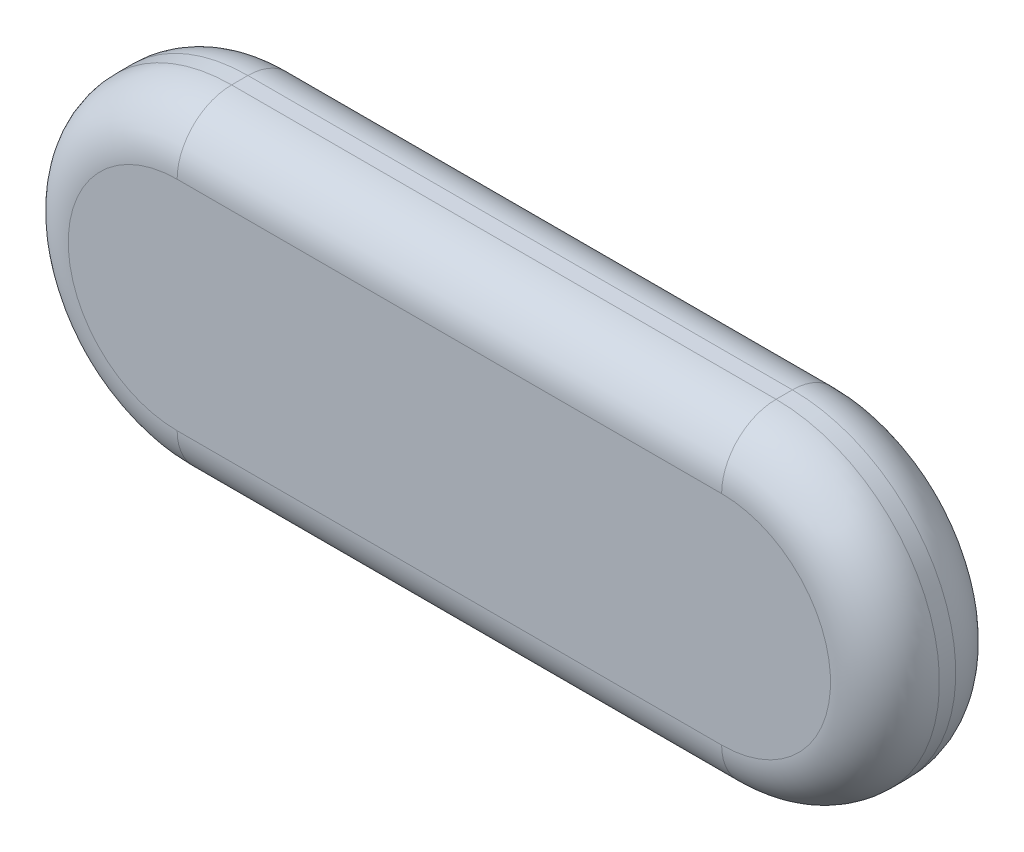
ISO-10303-21;
HEADER;
FILE_DESCRIPTION(('STEP AP214'),'2;1');
FILE_NAME('part.step','',(''),(''),'','','');
FILE_SCHEMA(('AUTOMOTIVE_DESIGN { 1 0 10303 214 1 1 1 1 }'));
ENDSEC;
DATA;
#1=APPLICATION_CONTEXT('core data for automotive mechanical design processes');
#2=APPLICATION_PROTOCOL_DEFINITION('international standard','automotive_design',2000,#1);
#3=PRODUCT_CONTEXT('',#1,'mechanical');
#4=PRODUCT('Part','Part','',(#3));
#5=PRODUCT_RELATED_PRODUCT_CATEGORY('part','',(#4));
#6=PRODUCT_DEFINITION_FORMATION('','',#4);
#7=PRODUCT_DEFINITION_CONTEXT('part definition',#1,'design');
#8=PRODUCT_DEFINITION('design','',#6,#7);
#9=PRODUCT_DEFINITION_SHAPE('','',#8);
#10=(LENGTH_UNIT() NAMED_UNIT(*) SI_UNIT(.MILLI.,.METRE.));
#11=(NAMED_UNIT(*) PLANE_ANGLE_UNIT() SI_UNIT($,.RADIAN.));
#12=(NAMED_UNIT(*) SI_UNIT($,.STERADIAN.) SOLID_ANGLE_UNIT());
#13=UNCERTAINTY_MEASURE_WITH_UNIT(LENGTH_MEASURE(1.E-05),#10,'distance_accuracy_value','');
#14=(GEOMETRIC_REPRESENTATION_CONTEXT(3) GLOBAL_UNCERTAINTY_ASSIGNED_CONTEXT((#13)) GLOBAL_UNIT_ASSIGNED_CONTEXT((#10,
#11,#12)) REPRESENTATION_CONTEXT('',''));
#15=CARTESIAN_POINT('',(0.,0.,0.));
#16=DIRECTION('',(0.,0.,1.));
#17=DIRECTION('',(1.,0.,0.));
#18=AXIS2_PLACEMENT_3D('',#15,#16,#17);
#19=CARTESIAN_POINT('',(-5.,-23.375,1.));
#20=DIRECTION('',(0.,0.,-1.));
#21=DIRECTION('',(-1.,0.,0.));
#22=AXIS2_PLACEMENT_3D('',#19,#20,#21);
#23=CYLINDRICAL_SURFACE('',#22,3.);
#24=DIRECTION('',(0.,0.,-1.));
#25=VECTOR('',#24,1.);
#26=CARTESIAN_POINT('',(-5.,-20.375,1.));
#27=LINE('',#26,#25);
#28=CARTESIAN_POINT('',(-5.,-20.375,0.));
#29=VERTEX_POINT('',#28);
#30=CARTESIAN_POINT('',(-5.,-20.375,-0.3));
#31=VERTEX_POINT('',#30);
#32=EDGE_CURVE('E157',#29,#31,#27,.T.);
#33=ORIENTED_EDGE('',*,*,#32,.T.);
#34=CARTESIAN_POINT('',(-5.,-23.375,-0.3));
#35=DIRECTION('',(0.,0.,1.));
#36=DIRECTION('',(1.,0.,0.));
#37=AXIS2_PLACEMENT_3D('',#34,#35,#36);
#38=CIRCLE('',#37,3.);
#39=CARTESIAN_POINT('',(-5.,-26.375,-0.3));
#40=VERTEX_POINT('',#39);
#41=EDGE_CURVE('E110',#31,#40,#38,.T.);
#42=ORIENTED_EDGE('',*,*,#41,.T.);
#43=DIRECTION('',(0.,0.,-1.));
#44=VECTOR('',#43,1.);
#45=CARTESIAN_POINT('',(-5.,-26.375,1.));
#46=LINE('',#45,#44);
#47=CARTESIAN_POINT('',(-5.,-26.375,0.));
#48=VERTEX_POINT('',#47);
#49=EDGE_CURVE('E123',#48,#40,#46,.T.);
#50=ORIENTED_EDGE('',*,*,#49,.F.);
#51=CARTESIAN_POINT('',(-5.,-23.375,0.));
#52=DIRECTION('',(0.,0.,1.));
#53=DIRECTION('',(1.,0.,0.));
#54=AXIS2_PLACEMENT_3D('',#51,#52,#53);
#55=CIRCLE('',#54,3.);
#56=EDGE_CURVE('E129',#48,#29,#55,.F.);
#57=ORIENTED_EDGE('',*,*,#56,.T.);
#58=EDGE_LOOP('',(#33,#42,#50,#57));
#59=FACE_BOUND('',#58,.T.);
#60=ADVANCED_FACE('F37',(#59),#23,.T.);
#61=CARTESIAN_POINT('',(-5.,-26.375,1.));
#62=DIRECTION('',(0.,1.,0.));
#63=DIRECTION('',(0.,0.,1.));
#64=AXIS2_PLACEMENT_3D('',#61,#62,#63);
#65=PLANE('',#64);
#66=ORIENTED_EDGE('',*,*,#49,.T.);
#67=DIRECTION('',(-1.,0.,0.));
#68=VECTOR('',#67,1.);
#69=CARTESIAN_POINT('',(-5.,-26.375,-0.3));
#70=LINE('',#69,#68);
#71=CARTESIAN_POINT('',(5.,-26.375,-0.3));
#72=VERTEX_POINT('',#71);
#73=EDGE_CURVE('E138',#40,#72,#70,.F.);
#74=ORIENTED_EDGE('',*,*,#73,.T.);
#75=DIRECTION('',(0.,0.,-1.));
#76=VECTOR('',#75,1.);
#77=CARTESIAN_POINT('',(5.,-26.375,1.));
#78=LINE('',#77,#76);
#79=CARTESIAN_POINT('',(5.,-26.375,0.));
#80=VERTEX_POINT('',#79);
#81=EDGE_CURVE('E184',#80,#72,#78,.T.);
#82=ORIENTED_EDGE('',*,*,#81,.F.);
#83=DIRECTION('',(1.,0.,0.));
#84=VECTOR('',#83,1.);
#85=CARTESIAN_POINT('',(-5.,-26.375,0.));
#86=LINE('',#85,#84);
#87=EDGE_CURVE('E136',#80,#48,#86,.F.);
#88=ORIENTED_EDGE('',*,*,#87,.T.);
#89=EDGE_LOOP('',(#66,#74,#82,#88));
#90=FACE_BOUND('',#89,.T.);
#91=ADVANCED_FACE('F198',(#90),#65,.F.);
#92=CARTESIAN_POINT('',(5.,-23.375,1.));
#93=DIRECTION('',(0.,0.,-1.));
#94=DIRECTION('',(-1.,0.,0.));
#95=AXIS2_PLACEMENT_3D('',#92,#93,#94);
#96=CYLINDRICAL_SURFACE('',#95,3.);
#97=ORIENTED_EDGE('',*,*,#81,.T.);
#98=CARTESIAN_POINT('',(5.,-23.375,-0.3));
#99=DIRECTION('',(0.,0.,1.));
#100=DIRECTION('',(1.,0.,0.));
#101=AXIS2_PLACEMENT_3D('',#98,#99,#100);
#102=CIRCLE('',#101,3.);
#103=CARTESIAN_POINT('',(5.,-20.375,-0.3));
#104=VERTEX_POINT('',#103);
#105=EDGE_CURVE('E143',#72,#104,#102,.T.);
#106=ORIENTED_EDGE('',*,*,#105,.T.);
#107=DIRECTION('',(0.,0.,-1.));
#108=VECTOR('',#107,1.);
#109=CARTESIAN_POINT('',(5.,-20.375,1.));
#110=LINE('',#109,#108);
#111=CARTESIAN_POINT('',(5.,-20.375,0.));
#112=VERTEX_POINT('',#111);
#113=EDGE_CURVE('E182',#112,#104,#110,.T.);
#114=ORIENTED_EDGE('',*,*,#113,.F.);
#115=CARTESIAN_POINT('',(5.,-23.375,0.));
#116=DIRECTION('',(0.,0.,1.));
#117=DIRECTION('',(1.,0.,0.));
#118=AXIS2_PLACEMENT_3D('',#115,#116,#117);
#119=CIRCLE('',#118,3.);
#120=EDGE_CURVE('E140',#112,#80,#119,.F.);
#121=ORIENTED_EDGE('',*,*,#120,.T.);
#122=EDGE_LOOP('',(#97,#106,#114,#121));
#123=FACE_BOUND('',#122,.T.);
#124=ADVANCED_FACE('F200',(#123),#96,.T.);
#125=CARTESIAN_POINT('',(5.,-20.375,1.));
#126=DIRECTION('',(0.,-1.,0.));
#127=DIRECTION('',(0.,0.,-1.));
#128=AXIS2_PLACEMENT_3D('',#125,#126,#127);
#129=PLANE('',#128);
#130=ORIENTED_EDGE('',*,*,#113,.T.);
#131=DIRECTION('',(1.,0.,0.));
#132=VECTOR('',#131,1.);
#133=CARTESIAN_POINT('',(5.,-20.375,-0.3));
#134=LINE('',#133,#132);
#135=EDGE_CURVE('E11',#104,#31,#134,.F.);
#136=ORIENTED_EDGE('',*,*,#135,.T.);
#137=ORIENTED_EDGE('',*,*,#32,.F.);
#138=DIRECTION('',(-1.,0.,0.));
#139=VECTOR('',#138,1.);
#140=CARTESIAN_POINT('',(5.,-20.375,0.));
#141=LINE('',#140,#139);
#142=EDGE_CURVE('E46',#29,#112,#141,.F.);
#143=ORIENTED_EDGE('',*,*,#142,.T.);
#144=EDGE_LOOP('',(#130,#136,#137,#143));
#145=FACE_BOUND('',#144,.T.);
#146=ADVANCED_FACE('F180',(#145),#129,.F.);
#147=CARTESIAN_POINT('',(-5.,-23.375,1.));
#148=DIRECTION('',(0.,0.,1.));
#149=DIRECTION('',(1.,0.,0.));
#150=AXIS2_PLACEMENT_3D('',#147,#148,#149);
#151=PLANE('',#150);
#152=DIRECTION('',(1.,0.,0.));
#153=VECTOR('',#152,1.);
#154=CARTESIAN_POINT('',(5.,-25.375,1.));
#155=LINE('',#154,#153);
#156=CARTESIAN_POINT('',(-5.,-25.375,1.));
#157=VERTEX_POINT('',#156);
#158=CARTESIAN_POINT('',(5.,-25.375,1.));
#159=VERTEX_POINT('',#158);
#160=EDGE_CURVE('E54',#157,#159,#155,.T.);
#161=ORIENTED_EDGE('',*,*,#160,.T.);
#162=CARTESIAN_POINT('',(5.,-23.375,1.));
#163=DIRECTION('',(0.,0.,1.));
#164=DIRECTION('',(1.,0.,0.));
#165=AXIS2_PLACEMENT_3D('',#162,#163,#164);
#166=CIRCLE('',#165,2.);
#167=CARTESIAN_POINT('',(5.,-21.375,1.));
#168=VERTEX_POINT('',#167);
#169=EDGE_CURVE('E149',#159,#168,#166,.T.);
#170=ORIENTED_EDGE('',*,*,#169,.T.);
#171=DIRECTION('',(-1.,0.,0.));
#172=VECTOR('',#171,1.);
#173=CARTESIAN_POINT('',(-5.,-21.375,1.));
#174=LINE('',#173,#172);
#175=CARTESIAN_POINT('',(-5.,-21.375,1.));
#176=VERTEX_POINT('',#175);
#177=EDGE_CURVE('E145',#168,#176,#174,.T.);
#178=ORIENTED_EDGE('',*,*,#177,.T.);
#179=CARTESIAN_POINT('',(-5.,-23.375,1.));
#180=DIRECTION('',(0.,0.,1.));
#181=DIRECTION('',(1.,0.,0.));
#182=AXIS2_PLACEMENT_3D('',#179,#180,#181);
#183=CIRCLE('',#182,2.);
#184=EDGE_CURVE('E59',#176,#157,#183,.T.);
#185=ORIENTED_EDGE('',*,*,#184,.T.);
#186=EDGE_LOOP('',(#161,#170,#178,#185));
#187=FACE_BOUND('',#186,.T.);
#188=ADVANCED_FACE('F207',(#187),#151,.T.);
#189=CARTESIAN_POINT('',(-5.,-23.375,-1.3));
#190=DIRECTION('',(0.,0.,1.));
#191=DIRECTION('',(1.,0.,0.));
#192=AXIS2_PLACEMENT_3D('',#189,#190,#191);
#193=PLANE('',#192);
#194=DIRECTION('',(-1.,0.,0.));
#195=VECTOR('',#194,1.);
#196=CARTESIAN_POINT('',(-5.,-25.375,-1.3));
#197=LINE('',#196,#195);
#198=CARTESIAN_POINT('',(5.,-25.375,-1.3));
#199=VERTEX_POINT('',#198);
#200=CARTESIAN_POINT('',(-5.,-25.375,-1.3));
#201=VERTEX_POINT('',#200);
#202=EDGE_CURVE('E127',#199,#201,#197,.T.);
#203=ORIENTED_EDGE('',*,*,#202,.T.);
#204=CARTESIAN_POINT('',(-5.,-23.375,-1.3));
#205=DIRECTION('',(0.,0.,1.));
#206=DIRECTION('',(1.,0.,0.));
#207=AXIS2_PLACEMENT_3D('',#204,#205,#206);
#208=CIRCLE('',#207,2.);
#209=CARTESIAN_POINT('',(-5.,-21.375,-1.3));
#210=VERTEX_POINT('',#209);
#211=EDGE_CURVE('E108',#201,#210,#208,.F.);
#212=ORIENTED_EDGE('',*,*,#211,.T.);
#213=DIRECTION('',(1.,0.,0.));
#214=VECTOR('',#213,1.);
#215=CARTESIAN_POINT('',(-5.,-21.375,-1.3));
#216=LINE('',#215,#214);
#217=CARTESIAN_POINT('',(5.,-21.375,-1.3));
#218=VERTEX_POINT('',#217);
#219=EDGE_CURVE('E116',#210,#218,#216,.T.);
#220=ORIENTED_EDGE('',*,*,#219,.T.);
#221=CARTESIAN_POINT('',(5.,-23.375,-1.3));
#222=DIRECTION('',(0.,0.,1.));
#223=DIRECTION('',(1.,0.,0.));
#224=AXIS2_PLACEMENT_3D('',#221,#222,#223);
#225=CIRCLE('',#224,2.);
#226=EDGE_CURVE('E122',#218,#199,#225,.F.);
#227=ORIENTED_EDGE('',*,*,#226,.T.);
#228=EDGE_LOOP('',(#203,#212,#220,#227));
#229=FACE_BOUND('',#228,.T.);
#230=ADVANCED_FACE('F125',(#229),#193,.F.);
#231=CARTESIAN_POINT('',(5.,-23.375,-0.3));
#232=DIRECTION('',(0.,0.,1.));
#233=DIRECTION('',(1.,0.,0.));
#234=AXIS2_PLACEMENT_3D('',#231,#232,#233);
#235=TOROIDAL_SURFACE('',#234,2.,1.);
#236=CARTESIAN_POINT('',(5.,-21.375,-0.3));
#237=DIRECTION('',(-1.,0.,0.));
#238=DIRECTION('',(0.,0.,1.));
#239=AXIS2_PLACEMENT_3D('',#236,#237,#238);
#240=CIRCLE('',#239,1.);
#241=EDGE_CURVE('E119',#104,#218,#240,.T.);
#242=ORIENTED_EDGE('',*,*,#241,.F.);
#243=ORIENTED_EDGE('',*,*,#105,.F.);
#244=CARTESIAN_POINT('',(5.,-25.375,-0.3));
#245=DIRECTION('',(-1.,0.,0.));
#246=DIRECTION('',(0.,0.,1.));
#247=AXIS2_PLACEMENT_3D('',#244,#245,#246);
#248=CIRCLE('',#247,1.);
#249=EDGE_CURVE('E154',#199,#72,#248,.T.);
#250=ORIENTED_EDGE('',*,*,#249,.F.);
#251=ORIENTED_EDGE('',*,*,#226,.F.);
#252=EDGE_LOOP('',(#242,#243,#250,#251));
#253=FACE_BOUND('',#252,.T.);
#254=ADVANCED_FACE('F192',(#253),#235,.T.);
#255=CARTESIAN_POINT('',(-5.,-25.375,-0.3));
#256=DIRECTION('',(-1.,0.,0.));
#257=DIRECTION('',(0.,0.,1.));
#258=AXIS2_PLACEMENT_3D('',#255,#256,#257);
#259=CYLINDRICAL_SURFACE('',#258,1.);
#260=ORIENTED_EDGE('',*,*,#249,.T.);
#261=ORIENTED_EDGE('',*,*,#73,.F.);
#262=CARTESIAN_POINT('',(-5.,-25.375,-0.3));
#263=DIRECTION('',(-1.,0.,0.));
#264=DIRECTION('',(0.,0.,1.));
#265=AXIS2_PLACEMENT_3D('',#262,#263,#264);
#266=CIRCLE('',#265,1.);
#267=EDGE_CURVE('E113',#201,#40,#266,.T.);
#268=ORIENTED_EDGE('',*,*,#267,.F.);
#269=ORIENTED_EDGE('',*,*,#202,.F.);
#270=EDGE_LOOP('',(#260,#261,#268,#269));
#271=FACE_BOUND('',#270,.T.);
#272=ADVANCED_FACE('F195',(#271),#259,.T.);
#273=CARTESIAN_POINT('',(-5.,-21.375,-0.3));
#274=DIRECTION('',(1.,0.,0.));
#275=DIRECTION('',(0.,0.,-1.));
#276=AXIS2_PLACEMENT_3D('',#273,#274,#275);
#277=CYLINDRICAL_SURFACE('',#276,1.);
#278=ORIENTED_EDGE('',*,*,#241,.T.);
#279=ORIENTED_EDGE('',*,*,#219,.F.);
#280=CARTESIAN_POINT('',(-5.,-21.375,-0.3));
#281=DIRECTION('',(-1.,0.,0.));
#282=DIRECTION('',(0.,0.,1.));
#283=AXIS2_PLACEMENT_3D('',#280,#281,#282);
#284=CIRCLE('',#283,1.);
#285=EDGE_CURVE('E104',#31,#210,#284,.T.);
#286=ORIENTED_EDGE('',*,*,#285,.F.);
#287=ORIENTED_EDGE('',*,*,#135,.F.);
#288=EDGE_LOOP('',(#278,#279,#286,#287));
#289=FACE_BOUND('',#288,.T.);
#290=ADVANCED_FACE('F117',(#289),#277,.T.);
#291=CARTESIAN_POINT('',(-5.,-23.375,-0.3));
#292=DIRECTION('',(0.,0.,1.));
#293=DIRECTION('',(1.,0.,0.));
#294=AXIS2_PLACEMENT_3D('',#291,#292,#293);
#295=TOROIDAL_SURFACE('',#294,2.,1.);
#296=ORIENTED_EDGE('',*,*,#267,.T.);
#297=ORIENTED_EDGE('',*,*,#41,.F.);
#298=ORIENTED_EDGE('',*,*,#285,.T.);
#299=ORIENTED_EDGE('',*,*,#211,.F.);
#300=EDGE_LOOP('',(#296,#297,#298,#299));
#301=FACE_BOUND('',#300,.T.);
#302=ADVANCED_FACE('F106',(#301),#295,.T.);
#303=CARTESIAN_POINT('',(-5.,-23.375,0.));
#304=DIRECTION('',(0.,0.,1.));
#305=DIRECTION('',(1.,0.,0.));
#306=AXIS2_PLACEMENT_3D('',#303,#304,#305);
#307=TOROIDAL_SURFACE('',#306,2.,1.);
#308=CARTESIAN_POINT('',(-5.,-21.375,0.));
#309=DIRECTION('',(1.,0.,0.));
#310=DIRECTION('',(0.,0.,-1.));
#311=AXIS2_PLACEMENT_3D('',#308,#309,#310);
#312=CIRCLE('',#311,1.);
#313=EDGE_CURVE('E161',#29,#176,#312,.T.);
#314=ORIENTED_EDGE('',*,*,#313,.F.);
#315=ORIENTED_EDGE('',*,*,#56,.F.);
#316=CARTESIAN_POINT('',(-5.,-25.375,0.));
#317=DIRECTION('',(1.,0.,0.));
#318=DIRECTION('',(0.,0.,-1.));
#319=AXIS2_PLACEMENT_3D('',#316,#317,#318);
#320=CIRCLE('',#319,1.);
#321=EDGE_CURVE('E41',#157,#48,#320,.T.);
#322=ORIENTED_EDGE('',*,*,#321,.F.);
#323=ORIENTED_EDGE('',*,*,#184,.F.);
#324=EDGE_LOOP('',(#314,#315,#322,#323));
#325=FACE_BOUND('',#324,.T.);
#326=ADVANCED_FACE('F39',(#325),#307,.T.);
#327=CARTESIAN_POINT('',(-5.,-25.375,0.));
#328=DIRECTION('',(-1.,0.,0.));
#329=DIRECTION('',(0.,0.,1.));
#330=AXIS2_PLACEMENT_3D('',#327,#328,#329);
#331=CYLINDRICAL_SURFACE('',#330,1.);
#332=ORIENTED_EDGE('',*,*,#321,.T.);
#333=ORIENTED_EDGE('',*,*,#87,.F.);
#334=CARTESIAN_POINT('',(5.,-25.375,0.));
#335=DIRECTION('',(1.,0.,0.));
#336=DIRECTION('',(0.,0.,-1.));
#337=AXIS2_PLACEMENT_3D('',#334,#335,#336);
#338=CIRCLE('',#337,1.);
#339=EDGE_CURVE('E160',#159,#80,#338,.T.);
#340=ORIENTED_EDGE('',*,*,#339,.F.);
#341=ORIENTED_EDGE('',*,*,#160,.F.);
#342=EDGE_LOOP('',(#332,#333,#340,#341));
#343=FACE_BOUND('',#342,.T.);
#344=ADVANCED_FACE('F170',(#343),#331,.T.);
#345=CARTESIAN_POINT('',(-5.,-21.375,0.));
#346=DIRECTION('',(1.,0.,0.));
#347=DIRECTION('',(0.,0.,-1.));
#348=AXIS2_PLACEMENT_3D('',#345,#346,#347);
#349=CYLINDRICAL_SURFACE('',#348,1.);
#350=ORIENTED_EDGE('',*,*,#313,.T.);
#351=ORIENTED_EDGE('',*,*,#177,.F.);
#352=CARTESIAN_POINT('',(5.,-21.375,0.));
#353=DIRECTION('',(1.,0.,0.));
#354=DIRECTION('',(0.,0.,-1.));
#355=AXIS2_PLACEMENT_3D('',#352,#353,#354);
#356=CIRCLE('',#355,1.);
#357=EDGE_CURVE('E158',#112,#168,#356,.T.);
#358=ORIENTED_EDGE('',*,*,#357,.F.);
#359=ORIENTED_EDGE('',*,*,#142,.F.);
#360=EDGE_LOOP('',(#350,#351,#358,#359));
#361=FACE_BOUND('',#360,.T.);
#362=ADVANCED_FACE('F206',(#361),#349,.T.);
#363=CARTESIAN_POINT('',(5.,-23.375,0.));
#364=DIRECTION('',(0.,0.,1.));
#365=DIRECTION('',(1.,0.,0.));
#366=AXIS2_PLACEMENT_3D('',#363,#364,#365);
#367=TOROIDAL_SURFACE('',#366,2.,1.);
#368=ORIENTED_EDGE('',*,*,#339,.T.);
#369=ORIENTED_EDGE('',*,*,#120,.F.);
#370=ORIENTED_EDGE('',*,*,#357,.T.);
#371=ORIENTED_EDGE('',*,*,#169,.F.);
#372=EDGE_LOOP('',(#368,#369,#370,#371));
#373=FACE_BOUND('',#372,.T.);
#374=ADVANCED_FACE('F204',(#373),#367,.T.);
#375=CLOSED_SHELL('',(#60,#91,#124,#146,#188,#230,#254,#272,#290,#302,#326,#344,#362,#374));
#376=MANIFOLD_SOLID_BREP('B2',#375);
#377=ADVANCED_BREP_SHAPE_REPRESENTATION('',(#18,#376),#14);
#378=SHAPE_DEFINITION_REPRESENTATION(#9,#377);
ENDSEC;
END-ISO-10303-21;
